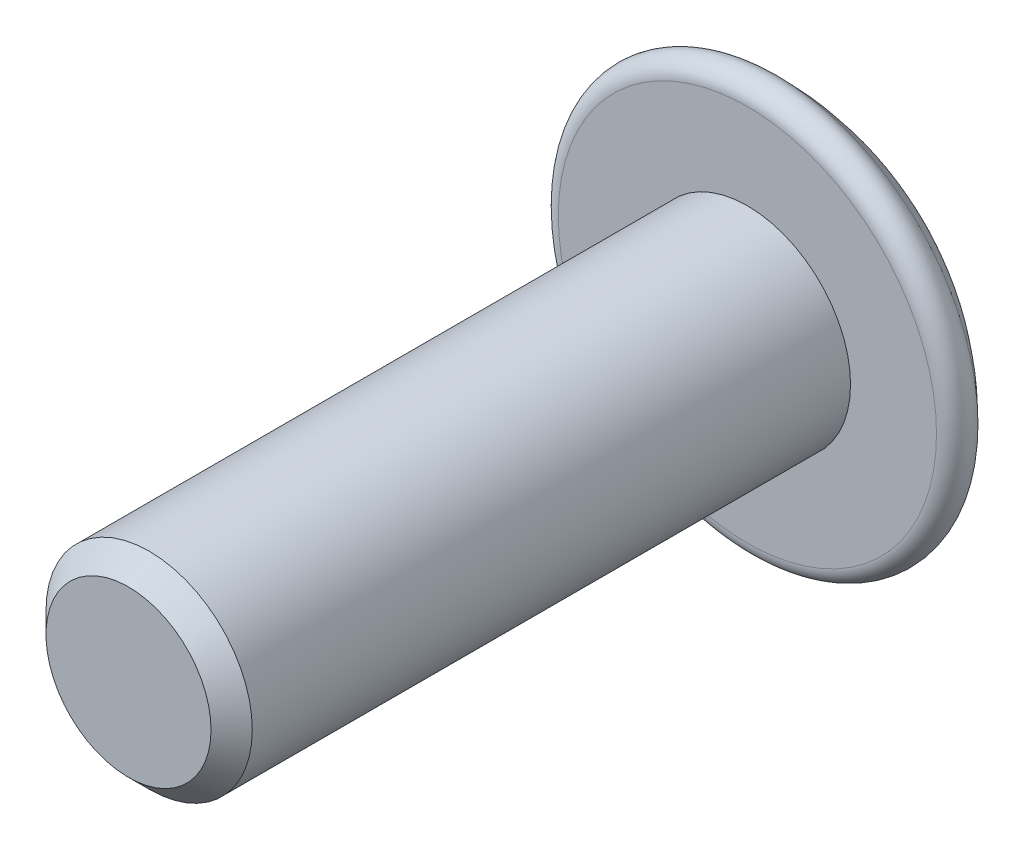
ISO-10303-21;
HEADER;
FILE_DESCRIPTION(('STEP AP214'),'2;1');
FILE_NAME('part.step','',(''),(''),'','','');
FILE_SCHEMA(('AUTOMOTIVE_DESIGN { 1 0 10303 214 1 1 1 1 }'));
ENDSEC;
DATA;
#1=APPLICATION_CONTEXT('core data for automotive mechanical design processes');
#2=APPLICATION_PROTOCOL_DEFINITION('international standard','automotive_design',2000,#1);
#3=PRODUCT_CONTEXT('',#1,'mechanical');
#4=PRODUCT('Part','Part','',(#3));
#5=PRODUCT_RELATED_PRODUCT_CATEGORY('part','',(#4));
#6=PRODUCT_DEFINITION_FORMATION('','',#4);
#7=PRODUCT_DEFINITION_CONTEXT('part definition',#1,'design');
#8=PRODUCT_DEFINITION('design','',#6,#7);
#9=PRODUCT_DEFINITION_SHAPE('','',#8);
#10=(LENGTH_UNIT() NAMED_UNIT(*) SI_UNIT(.MILLI.,.METRE.));
#11=(NAMED_UNIT(*) PLANE_ANGLE_UNIT() SI_UNIT($,.RADIAN.));
#12=(NAMED_UNIT(*) SI_UNIT($,.STERADIAN.) SOLID_ANGLE_UNIT());
#13=UNCERTAINTY_MEASURE_WITH_UNIT(LENGTH_MEASURE(1.E-05),#10,'distance_accuracy_value','');
#14=(GEOMETRIC_REPRESENTATION_CONTEXT(3) GLOBAL_UNCERTAINTY_ASSIGNED_CONTEXT((#13)) GLOBAL_UNIT_ASSIGNED_CONTEXT((#10,
#11,#12)) REPRESENTATION_CONTEXT('',''));
#15=CARTESIAN_POINT('',(0.,0.,0.));
#16=DIRECTION('',(0.,0.,1.));
#17=DIRECTION('',(1.,0.,0.));
#18=AXIS2_PLACEMENT_3D('',#15,#16,#17);
#19=CARTESIAN_POINT('',(0.,0.,4.92608695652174));
#20=DIRECTION('',(0.,0.,-1.));
#21=DIRECTION('',(1.,0.,0.));
#22=AXIS2_PLACEMENT_3D('',#19,#20,#21);
#23=SPHERICAL_SURFACE('',#22,8.22608695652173);
#24=CARTESIAN_POINT('',(0.,0.,-0.851153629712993));
#25=DIRECTION('',(0.,0.,-1.));
#26=DIRECTION('',(-1.,0.,0.));
#27=AXIS2_PLACEMENT_3D('',#24,#25,#26);
#28=CIRCLE('',#27,5.85593697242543);
#29=CARTESIAN_POINT('',(-5.85593697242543,0.,-0.851153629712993));
#30=VERTEX_POINT('',#29);
#31=EDGE_CURVE('E89',#30,#30,#28,.T.);
#32=ORIENTED_EDGE('',*,*,#31,.T.);
#33=EDGE_LOOP('',(#32));
#34=FACE_BOUND('',#33,.T.);
#35=CARTESIAN_POINT('',(-1.,1.73205080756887,4.92608695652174));
#36=DIRECTION('',(0.5,-0.866025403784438,0.));
#37=DIRECTION('',(0.866025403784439,0.5,0.));
#38=AXIS2_PLACEMENT_3D('',#35,#36,#37);
#39=CIRCLE('',#38,7.97925476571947);
#40=CARTESIAN_POINT('',(-2.,1.15470053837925,-2.96917575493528));
#41=VERTEX_POINT('',#40);
#42=CARTESIAN_POINT('',(0.,2.30940107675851,-2.96917575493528));
#43=VERTEX_POINT('',#42);
#44=EDGE_CURVE('E110',#41,#43,#39,.T.);
#45=ORIENTED_EDGE('',*,*,#44,.F.);
#46=CARTESIAN_POINT('',(-2.,0.,4.92608695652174));
#47=DIRECTION('',(1.,0.,0.));
#48=DIRECTION('',(0.,0.,-1.));
#49=AXIS2_PLACEMENT_3D('',#46,#47,#48);
#50=CIRCLE('',#49,7.97925476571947);
#51=CARTESIAN_POINT('',(-2.,-1.15470053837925,-2.96917575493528));
#52=VERTEX_POINT('',#51);
#53=EDGE_CURVE('E41',#52,#41,#50,.T.);
#54=ORIENTED_EDGE('',*,*,#53,.F.);
#55=CARTESIAN_POINT('',(-1.,-1.73205080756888,4.92608695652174));
#56=DIRECTION('',(0.5,0.866025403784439,0.));
#57=DIRECTION('',(-0.866025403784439,0.5,0.));
#58=AXIS2_PLACEMENT_3D('',#55,#56,#57);
#59=CIRCLE('',#58,7.97925476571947);
#60=CARTESIAN_POINT('',(0.,-2.30940107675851,-2.96917575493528));
#61=VERTEX_POINT('',#60);
#62=EDGE_CURVE('E107',#61,#52,#59,.T.);
#63=ORIENTED_EDGE('',*,*,#62,.F.);
#64=CARTESIAN_POINT('',(1.,-1.73205080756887,4.92608695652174));
#65=DIRECTION('',(-0.5,0.866025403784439,0.));
#66=DIRECTION('',(-0.866025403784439,-0.5,0.));
#67=AXIS2_PLACEMENT_3D('',#64,#65,#66);
#68=CIRCLE('',#67,7.97925476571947);
#69=CARTESIAN_POINT('',(2.,-1.15470053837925,-2.96917575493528));
#70=VERTEX_POINT('',#69);
#71=EDGE_CURVE('E105',#70,#61,#68,.T.);
#72=ORIENTED_EDGE('',*,*,#71,.F.);
#73=CARTESIAN_POINT('',(2.,0.,4.92608695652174));
#74=DIRECTION('',(-1.,0.,0.));
#75=DIRECTION('',(0.,0.,1.));
#76=AXIS2_PLACEMENT_3D('',#73,#74,#75);
#77=CIRCLE('',#76,7.97925476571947);
#78=CARTESIAN_POINT('',(2.,1.15470053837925,-2.96917575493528));
#79=VERTEX_POINT('',#78);
#80=EDGE_CURVE('E103',#79,#70,#77,.T.);
#81=ORIENTED_EDGE('',*,*,#80,.F.);
#82=CARTESIAN_POINT('',(1.,1.73205080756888,4.92608695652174));
#83=DIRECTION('',(-0.5,-0.866025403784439,0.));
#84=DIRECTION('',(0.866025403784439,-0.5,0.));
#85=AXIS2_PLACEMENT_3D('',#82,#83,#84);
#86=CIRCLE('',#85,7.97925476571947);
#87=EDGE_CURVE('E101',#43,#79,#86,.T.);
#88=ORIENTED_EDGE('',*,*,#87,.F.);
#89=EDGE_LOOP('',(#45,#54,#63,#72,#81,#88));
#90=FACE_BOUND('',#89,.T.);
#91=ADVANCED_FACE('F18',(#34,#90),#23,.T.);
#92=CARTESIAN_POINT('',(0.,0.,0.));
#93=DIRECTION('',(0.,0.,-1.));
#94=DIRECTION('',(-1.,0.,0.));
#95=AXIS2_PLACEMENT_3D('',#92,#93,#94);
#96=PLANE('',#95);
#97=CARTESIAN_POINT('',(0.,0.,0.));
#98=DIRECTION('',(0.,0.,1.));
#99=DIRECTION('',(1.,0.,0.));
#100=AXIS2_PLACEMENT_3D('',#97,#98,#99);
#101=CIRCLE('',#100,3.);
#102=CARTESIAN_POINT('',(3.,0.,0.));
#103=VERTEX_POINT('',#102);
#104=EDGE_CURVE('E86',#103,#103,#101,.T.);
#105=ORIENTED_EDGE('',*,*,#104,.F.);
#106=EDGE_LOOP('',(#105));
#107=FACE_BOUND('',#106,.T.);
#108=CARTESIAN_POINT('',(0.,0.,0.));
#109=DIRECTION('',(0.,0.,-1.));
#110=DIRECTION('',(-1.,0.,0.));
#111=AXIS2_PLACEMENT_3D('',#108,#109,#110);
#112=CIRCLE('',#111,5.5);
#113=CARTESIAN_POINT('',(-5.5,0.,0.));
#114=VERTEX_POINT('',#113);
#115=EDGE_CURVE('E93',#114,#114,#112,.T.);
#116=ORIENTED_EDGE('',*,*,#115,.F.);
#117=EDGE_LOOP('',(#116));
#118=FACE_BOUND('',#117,.T.);
#119=ADVANCED_FACE('F128',(#107,#118),#96,.F.);
#120=CARTESIAN_POINT('',(0.,0.,-0.5));
#121=DIRECTION('',(0.,0.,-1.));
#122=DIRECTION('',(-1.,0.,0.));
#123=AXIS2_PLACEMENT_3D('',#120,#121,#122);
#124=TOROIDAL_SURFACE('',#123,5.5,0.499999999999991);
#125=ORIENTED_EDGE('',*,*,#31,.F.);
#126=EDGE_LOOP('',(#125));
#127=FACE_BOUND('',#126,.T.);
#128=ORIENTED_EDGE('',*,*,#115,.T.);
#129=EDGE_LOOP('',(#128));
#130=FACE_BOUND('',#129,.T.);
#131=ADVANCED_FACE('F135',(#127,#130),#124,.T.);
#132=CARTESIAN_POINT('',(0.,2.30940107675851,-1.8));
#133=DIRECTION('',(0.5,-0.866025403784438,0.));
#134=DIRECTION('',(0.866025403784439,0.5,0.));
#135=AXIS2_PLACEMENT_3D('',#132,#133,#134);
#136=PLANE('',#135);
#137=ORIENTED_EDGE('',*,*,#44,.T.);
#138=DIRECTION('',(0.,0.,-1.));
#139=VECTOR('',#138,1.);
#140=CARTESIAN_POINT('',(0.,2.30940107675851,-1.8));
#141=LINE('',#140,#139);
#142=CARTESIAN_POINT('',(0.,2.30940107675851,-1.8));
#143=VERTEX_POINT('',#142);
#144=EDGE_CURVE('E33',#143,#43,#141,.T.);
#145=ORIENTED_EDGE('',*,*,#144,.F.);
#146=DIRECTION('',(-0.866025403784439,-0.5,0.));
#147=VECTOR('',#146,1.);
#148=CARTESIAN_POINT('',(0.,2.30940107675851,-1.8));
#149=LINE('',#148,#147);
#150=CARTESIAN_POINT('',(-2.,1.15470053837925,-1.8));
#151=VERTEX_POINT('',#150);
#152=EDGE_CURVE('E77',#143,#151,#149,.T.);
#153=ORIENTED_EDGE('',*,*,#152,.T.);
#154=DIRECTION('',(0.,0.,-1.));
#155=VECTOR('',#154,1.);
#156=CARTESIAN_POINT('',(-2.,1.15470053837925,-1.8));
#157=LINE('',#156,#155);
#158=EDGE_CURVE('E84',#151,#41,#157,.T.);
#159=ORIENTED_EDGE('',*,*,#158,.T.);
#160=EDGE_LOOP('',(#137,#145,#153,#159));
#161=FACE_BOUND('',#160,.T.);
#162=ADVANCED_FACE('F83',(#161),#136,.T.);
#163=CARTESIAN_POINT('',(-2.,1.15470053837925,-1.8));
#164=DIRECTION('',(1.,0.,0.));
#165=DIRECTION('',(0.,0.,-1.));
#166=AXIS2_PLACEMENT_3D('',#163,#164,#165);
#167=PLANE('',#166);
#168=ORIENTED_EDGE('',*,*,#53,.T.);
#169=ORIENTED_EDGE('',*,*,#158,.F.);
#170=DIRECTION('',(0.,-1.,0.));
#171=VECTOR('',#170,1.);
#172=CARTESIAN_POINT('',(-2.,1.15470053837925,-1.8));
#173=LINE('',#172,#171);
#174=CARTESIAN_POINT('',(-2.,-1.15470053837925,-1.8));
#175=VERTEX_POINT('',#174);
#176=EDGE_CURVE('E73',#151,#175,#173,.T.);
#177=ORIENTED_EDGE('',*,*,#176,.T.);
#178=DIRECTION('',(0.,0.,-1.));
#179=VECTOR('',#178,1.);
#180=CARTESIAN_POINT('',(-2.,-1.15470053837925,-1.8));
#181=LINE('',#180,#179);
#182=EDGE_CURVE('E90',#175,#52,#181,.T.);
#183=ORIENTED_EDGE('',*,*,#182,.T.);
#184=EDGE_LOOP('',(#168,#169,#177,#183));
#185=FACE_BOUND('',#184,.T.);
#186=ADVANCED_FACE('F88',(#185),#167,.T.);
#187=CARTESIAN_POINT('',(-2.,-1.15470053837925,-1.8));
#188=DIRECTION('',(0.5,0.866025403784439,0.));
#189=DIRECTION('',(-0.866025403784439,0.5,0.));
#190=AXIS2_PLACEMENT_3D('',#187,#188,#189);
#191=PLANE('',#190);
#192=ORIENTED_EDGE('',*,*,#62,.T.);
#193=ORIENTED_EDGE('',*,*,#182,.F.);
#194=DIRECTION('',(0.866025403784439,-0.5,0.));
#195=VECTOR('',#194,1.);
#196=CARTESIAN_POINT('',(-2.,-1.15470053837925,-1.8));
#197=LINE('',#196,#195);
#198=CARTESIAN_POINT('',(0.,-2.30940107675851,-1.8));
#199=VERTEX_POINT('',#198);
#200=EDGE_CURVE('E79',#175,#199,#197,.T.);
#201=ORIENTED_EDGE('',*,*,#200,.T.);
#202=DIRECTION('',(0.,0.,-1.));
#203=VECTOR('',#202,1.);
#204=CARTESIAN_POINT('',(0.,-2.30940107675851,-1.8));
#205=LINE('',#204,#203);
#206=EDGE_CURVE('E95',#199,#61,#205,.T.);
#207=ORIENTED_EDGE('',*,*,#206,.T.);
#208=EDGE_LOOP('',(#192,#193,#201,#207));
#209=FACE_BOUND('',#208,.T.);
#210=ADVANCED_FACE('F155',(#209),#191,.T.);
#211=CARTESIAN_POINT('',(0.,-2.30940107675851,-1.8));
#212=DIRECTION('',(-0.5,0.866025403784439,0.));
#213=DIRECTION('',(-0.866025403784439,-0.5,0.));
#214=AXIS2_PLACEMENT_3D('',#211,#212,#213);
#215=PLANE('',#214);
#216=ORIENTED_EDGE('',*,*,#71,.T.);
#217=ORIENTED_EDGE('',*,*,#206,.F.);
#218=DIRECTION('',(0.866025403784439,0.5,0.));
#219=VECTOR('',#218,1.);
#220=CARTESIAN_POINT('',(0.,-2.30940107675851,-1.8));
#221=LINE('',#220,#219);
#222=CARTESIAN_POINT('',(2.,-1.15470053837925,-1.8));
#223=VERTEX_POINT('',#222);
#224=EDGE_CURVE('E594',#199,#223,#221,.T.);
#225=ORIENTED_EDGE('',*,*,#224,.T.);
#226=DIRECTION('',(0.,0.,-1.));
#227=VECTOR('',#226,1.);
#228=CARTESIAN_POINT('',(2.,-1.15470053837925,-1.8));
#229=LINE('',#228,#227);
#230=EDGE_CURVE('E582',#223,#70,#229,.T.);
#231=ORIENTED_EDGE('',*,*,#230,.T.);
#232=EDGE_LOOP('',(#216,#217,#225,#231));
#233=FACE_BOUND('',#232,.T.);
#234=ADVANCED_FACE('F160',(#233),#215,.T.);
#235=CARTESIAN_POINT('',(2.,-1.15470053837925,-1.8));
#236=DIRECTION('',(-1.,0.,0.));
#237=DIRECTION('',(0.,0.,1.));
#238=AXIS2_PLACEMENT_3D('',#235,#236,#237);
#239=PLANE('',#238);
#240=ORIENTED_EDGE('',*,*,#80,.T.);
#241=ORIENTED_EDGE('',*,*,#230,.F.);
#242=DIRECTION('',(0.,1.,0.));
#243=VECTOR('',#242,1.);
#244=CARTESIAN_POINT('',(2.,-1.15470053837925,-1.8));
#245=LINE('',#244,#243);
#246=CARTESIAN_POINT('',(2.,1.15470053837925,-1.8));
#247=VERTEX_POINT('',#246);
#248=EDGE_CURVE('E581',#223,#247,#245,.T.);
#249=ORIENTED_EDGE('',*,*,#248,.T.);
#250=DIRECTION('',(0.,0.,-1.));
#251=VECTOR('',#250,1.);
#252=CARTESIAN_POINT('',(2.,1.15470053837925,-1.8));
#253=LINE('',#252,#251);
#254=EDGE_CURVE('E576',#247,#79,#253,.T.);
#255=ORIENTED_EDGE('',*,*,#254,.T.);
#256=EDGE_LOOP('',(#240,#241,#249,#255));
#257=FACE_BOUND('',#256,.T.);
#258=ADVANCED_FACE('F166',(#257),#239,.T.);
#259=CARTESIAN_POINT('',(2.,1.15470053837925,-1.8));
#260=DIRECTION('',(-0.5,-0.866025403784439,0.));
#261=DIRECTION('',(0.866025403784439,-0.5,0.));
#262=AXIS2_PLACEMENT_3D('',#259,#260,#261);
#263=PLANE('',#262);
#264=ORIENTED_EDGE('',*,*,#87,.T.);
#265=ORIENTED_EDGE('',*,*,#254,.F.);
#266=DIRECTION('',(-0.866025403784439,0.5,0.));
#267=VECTOR('',#266,1.);
#268=CARTESIAN_POINT('',(2.,1.15470053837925,-1.8));
#269=LINE('',#268,#267);
#270=EDGE_CURVE('E591',#247,#143,#269,.T.);
#271=ORIENTED_EDGE('',*,*,#270,.T.);
#272=ORIENTED_EDGE('',*,*,#144,.T.);
#273=EDGE_LOOP('',(#264,#265,#271,#272));
#274=FACE_BOUND('',#273,.T.);
#275=ADVANCED_FACE('F170',(#274),#263,.T.);
#276=CARTESIAN_POINT('',(-4.,0.,-1.8));
#277=DIRECTION('',(0.,0.,1.));
#278=DIRECTION('',(1.,0.,0.));
#279=AXIS2_PLACEMENT_3D('',#276,#277,#278);
#280=PLANE('',#279);
#281=ORIENTED_EDGE('',*,*,#152,.F.);
#282=ORIENTED_EDGE('',*,*,#270,.F.);
#283=ORIENTED_EDGE('',*,*,#248,.F.);
#284=ORIENTED_EDGE('',*,*,#224,.F.);
#285=ORIENTED_EDGE('',*,*,#200,.F.);
#286=ORIENTED_EDGE('',*,*,#176,.F.);
#287=EDGE_LOOP('',(#281,#282,#283,#284,#285,#286));
#288=FACE_BOUND('',#287,.T.);
#289=ADVANCED_FACE('F75',(#288),#280,.F.);
#290=CARTESIAN_POINT('',(0.,0.,18.));
#291=DIRECTION('',(0.,0.,1.));
#292=DIRECTION('',(1.,0.,0.));
#293=AXIS2_PLACEMENT_3D('',#290,#291,#292);
#294=PLANE('',#293);
#295=CARTESIAN_POINT('',(0.,0.,18.));
#296=DIRECTION('',(0.,0.,1.));
#297=DIRECTION('',(1.,0.,0.));
#298=AXIS2_PLACEMENT_3D('',#295,#296,#297);
#299=CIRCLE('',#298,2.4);
#300=CARTESIAN_POINT('',(2.4,0.,18.));
#301=VERTEX_POINT('',#300);
#302=EDGE_CURVE('E26',#301,#301,#299,.T.);
#303=ORIENTED_EDGE('',*,*,#302,.T.);
#304=EDGE_LOOP('',(#303));
#305=FACE_BOUND('',#304,.T.);
#306=ADVANCED_FACE('F114',(#305),#294,.T.);
#307=CARTESIAN_POINT('',(0.,0.,0.));
#308=DIRECTION('',(0.,0.,1.));
#309=DIRECTION('',(1.,0.,0.));
#310=AXIS2_PLACEMENT_3D('',#307,#308,#309);
#311=CYLINDRICAL_SURFACE('',#310,3.);
#312=CARTESIAN_POINT('',(0.,0.,17.4));
#313=DIRECTION('',(0.,0.,1.));
#314=DIRECTION('',(1.,0.,0.));
#315=AXIS2_PLACEMENT_3D('',#312,#313,#314);
#316=CIRCLE('',#315,3.);
#317=CARTESIAN_POINT('',(3.,0.,17.4));
#318=VERTEX_POINT('',#317);
#319=EDGE_CURVE('E11',#318,#318,#316,.F.);
#320=ORIENTED_EDGE('',*,*,#319,.T.);
#321=EDGE_LOOP('',(#320));
#322=FACE_BOUND('',#321,.T.);
#323=ORIENTED_EDGE('',*,*,#104,.T.);
#324=EDGE_LOOP('',(#323));
#325=FACE_BOUND('',#324,.T.);
#326=ADVANCED_FACE('F117',(#322,#325),#311,.T.);
#327=CARTESIAN_POINT('',(0.,0.,18.));
#328=DIRECTION('',(0.,0.,-1.));
#329=DIRECTION('',(-1.,0.,0.));
#330=AXIS2_PLACEMENT_3D('',#327,#328,#329);
#331=CONICAL_SURFACE('',#330,2.4,0.785398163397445);
#332=ORIENTED_EDGE('',*,*,#319,.F.);
#333=EDGE_LOOP('',(#332));
#334=FACE_BOUND('',#333,.T.);
#335=ORIENTED_EDGE('',*,*,#302,.F.);
#336=EDGE_LOOP('',(#335));
#337=FACE_BOUND('',#336,.T.);
#338=ADVANCED_FACE('F20',(#334,#337),#331,.T.);
#339=CLOSED_SHELL('',(#91,#119,#131,#162,#186,#210,#234,#258,#275,#289,#306,#326,#338));
#340=MANIFOLD_SOLID_BREP('B1',#339);
#341=ADVANCED_BREP_SHAPE_REPRESENTATION('',(#18,#340),#14);
#342=SHAPE_DEFINITION_REPRESENTATION(#9,#341);
ENDSEC;
END-ISO-10303-21;
